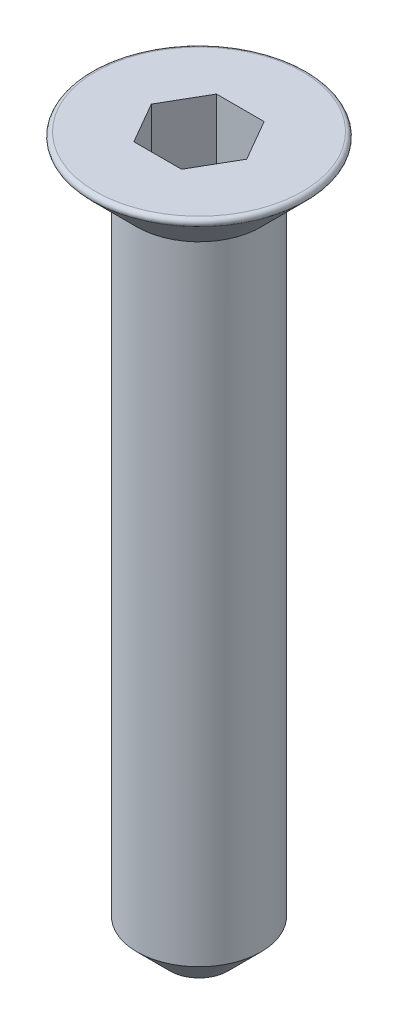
from build123d import *

# Parameters (mm, degrees)
CONG_1_R                = 0.1
CHANFREIN1_SIZE         = 0.8
ENL_V_MAT_EXTRU_1_DEPTH = 3


with BuildPart() as part:
    # Esquisse1 → R_volution1 (revolve)
    with BuildSketch(Plane.XY, mode=Mode.PRIVATE) as r_volution1_sk:
        Polygon((0, 0), (-2.75, 0), (-1.5, -1.25), (-1.5, -17.25), (0, -17.25), align=None)
    revolve(r_volution1_sk.sketch.rotate(Axis((0, 15.487971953, 0), (0, -1, 0)), 270), axis=Axis((0, 15.487971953, 0), (0, -1, 0)))

    # Cong_1
    cong_1_edges = [part.edges().sort_by_distance(p)[0] for p in [
        (0, 0, -2.75),
    ]]
    fillet(cong_1_edges, radius=CONG_1_R)

    # Chanfrein1
    chanfrein1_edges = [part.edges().sort_by_distance(p)[0] for p in [
        (0, -17.25, -1.5),
    ]]
    chamfer(chanfrein1_edges, length=CHANFREIN1_SIZE)

    # Esquisse2 → Enl_v. mat.-Extru.1 (cut)
    with BuildSketch(Plane(origin=(0, 0, 0), x_dir=(1, 0, 0), z_dir=(0, 1, 0))):
        Polygon((1.154700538, 0), (0.577350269, 1), (-0.577350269, 1), (-1.154700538, 0), (-0.577350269, -1), (0.577350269, -1), align=None)
    extrude(amount=-ENL_V_MAT_EXTRU_1_DEPTH, mode=Mode.SUBTRACT)


solid = part.part
